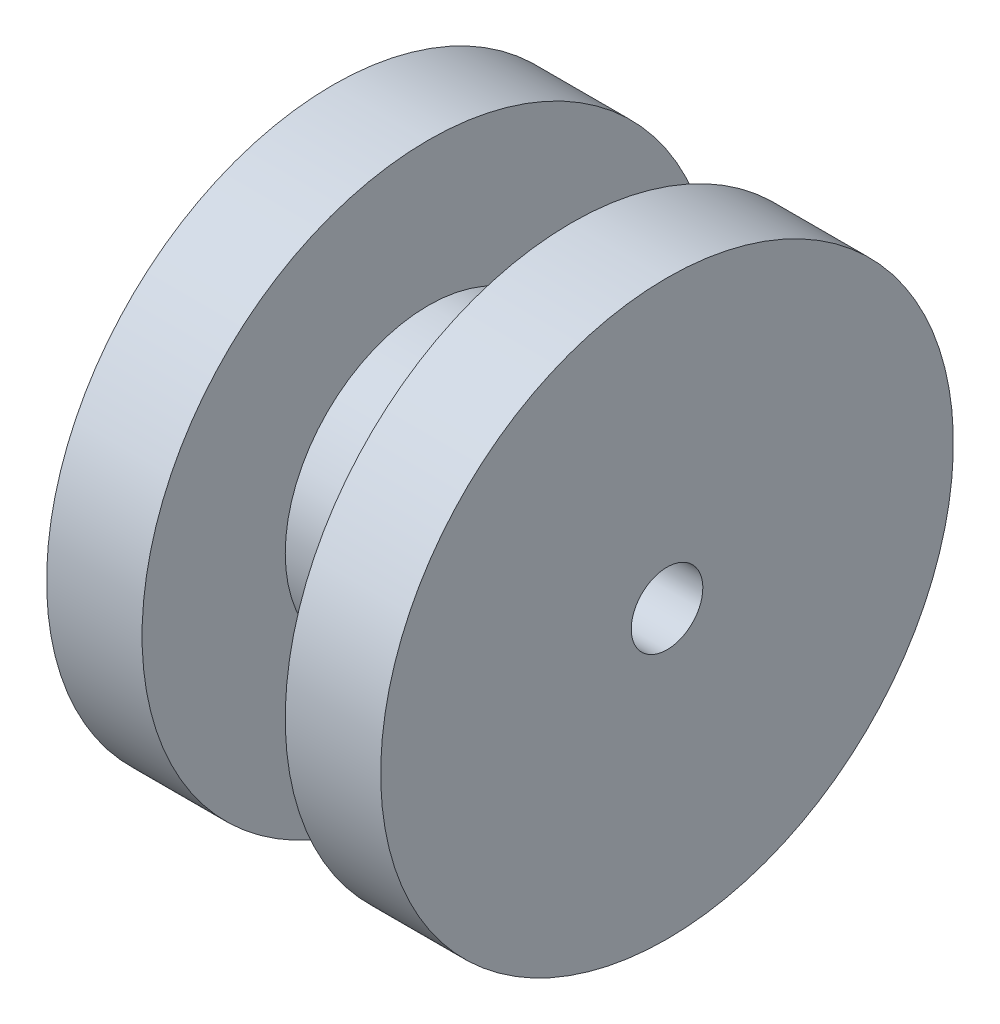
from build123d import *

# Parameters (mm, degrees)
ESQUISSE2_R             = 1.5
ENL_V_MAT_EXTRU_1_DEPTH = 23


with BuildPart() as part:
    # Esquisse1 → R_volution1 (revolve)
    with BuildSketch(Plane.XY, mode=Mode.PRIVATE) as r_volution1_sk:
        Polygon((7, 0), (-7, 0), (-7, 12), (-3, 12), (-3, 6), (3, 6), (3, 12), (7, 12), align=None)
    revolve(r_volution1_sk.sketch.rotate(Axis((-17.324587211, 0, 0), (1, 0, 0)), 180), axis=Axis((-17.324587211, 0, 0), (1, 0, 0)))

    # Esquisse2 → Enl_v. mat.-Extru.1 (cut, through all)
    with BuildSketch(Plane.ZY.offset(7)):
        with Locations(Location((0, 0, 0), (0, 0, 270))):
            Circle(ESQUISSE2_R)
    extrude(amount=-ENL_V_MAT_EXTRU_1_DEPTH, mode=Mode.SUBTRACT)


solid = part.part
